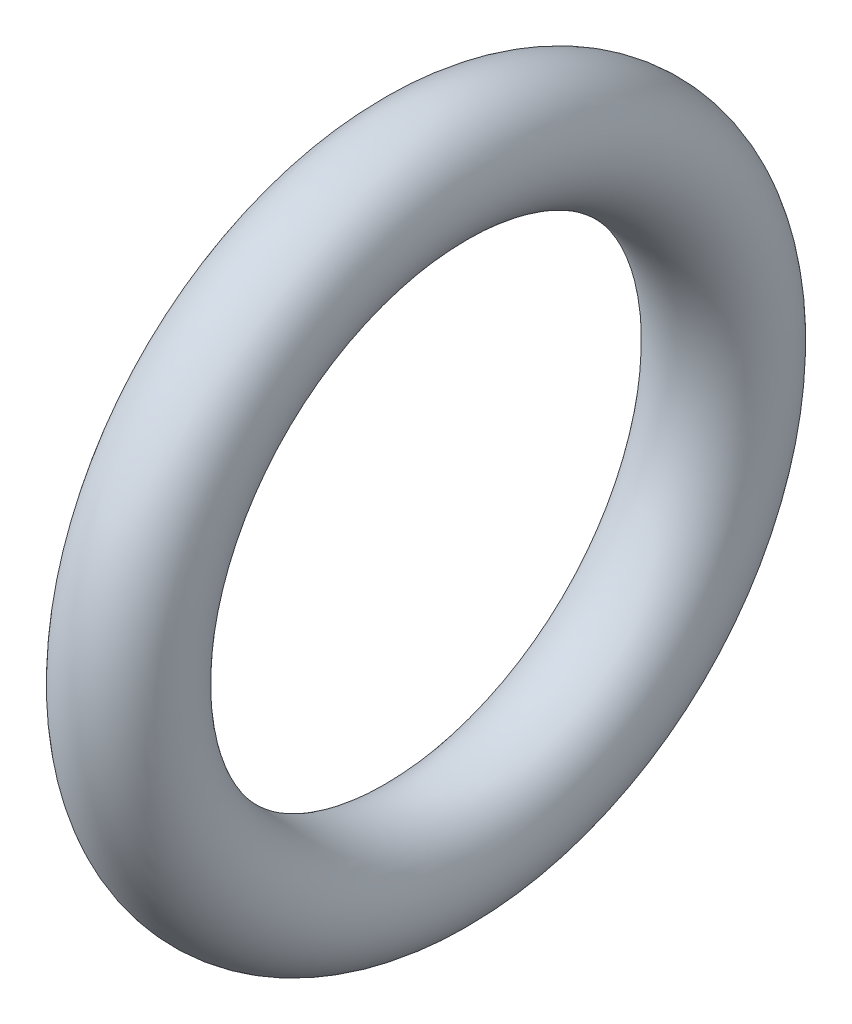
ISO-10303-21;
HEADER;
FILE_DESCRIPTION(('STEP AP214'),'2;1');
FILE_NAME('part.step','',(''),(''),'','','');
FILE_SCHEMA(('AUTOMOTIVE_DESIGN { 1 0 10303 214 1 1 1 1 }'));
ENDSEC;
DATA;
#1=APPLICATION_CONTEXT('core data for automotive mechanical design processes');
#2=APPLICATION_PROTOCOL_DEFINITION('international standard','automotive_design',2000,#1);
#3=PRODUCT_CONTEXT('',#1,'mechanical');
#4=PRODUCT('Part','Part','',(#3));
#5=PRODUCT_RELATED_PRODUCT_CATEGORY('part','',(#4));
#6=PRODUCT_DEFINITION_FORMATION('','',#4);
#7=PRODUCT_DEFINITION_CONTEXT('part definition',#1,'design');
#8=PRODUCT_DEFINITION('design','',#6,#7);
#9=PRODUCT_DEFINITION_SHAPE('','',#8);
#10=(LENGTH_UNIT() NAMED_UNIT(*) SI_UNIT(.MILLI.,.METRE.));
#11=(NAMED_UNIT(*) PLANE_ANGLE_UNIT() SI_UNIT($,.RADIAN.));
#12=(NAMED_UNIT(*) SI_UNIT($,.STERADIAN.) SOLID_ANGLE_UNIT());
#13=UNCERTAINTY_MEASURE_WITH_UNIT(LENGTH_MEASURE(1.E-05),#10,'distance_accuracy_value','');
#14=(GEOMETRIC_REPRESENTATION_CONTEXT(3) GLOBAL_UNCERTAINTY_ASSIGNED_CONTEXT((#13)) GLOBAL_UNIT_ASSIGNED_CONTEXT((#10,
#11,#12)) REPRESENTATION_CONTEXT('',''));
#15=CARTESIAN_POINT('',(0.,0.,0.));
#16=DIRECTION('',(0.,0.,1.));
#17=DIRECTION('',(1.,0.,0.));
#18=AXIS2_PLACEMENT_3D('',#15,#16,#17);
#19=CARTESIAN_POINT('',(6.5,0.,0.));
#20=DIRECTION('',(1.,0.,0.));
#21=DIRECTION('',(0.,-1.,0.));
#22=AXIS2_PLACEMENT_3D('',#19,#20,#21);
#23=TOROIDAL_SURFACE('',#22,21.325,4.16666666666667);
#24=CARTESIAN_POINT('',(6.5,-25.4916666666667,0.));
#25=VERTEX_POINT('',#24);
#26=VERTEX_LOOP('',#25);
#27=FACE_BOUND('',#26,.T.);
#28=ADVANCED_FACE('F12',(#27),#23,.T.);
#29=CLOSED_SHELL('',(#28));
#30=MANIFOLD_SOLID_BREP('B1',#29);
#31=ADVANCED_BREP_SHAPE_REPRESENTATION('',(#18,#30),#14);
#32=SHAPE_DEFINITION_REPRESENTATION(#9,#31);
ENDSEC;
END-ISO-10303-21;
